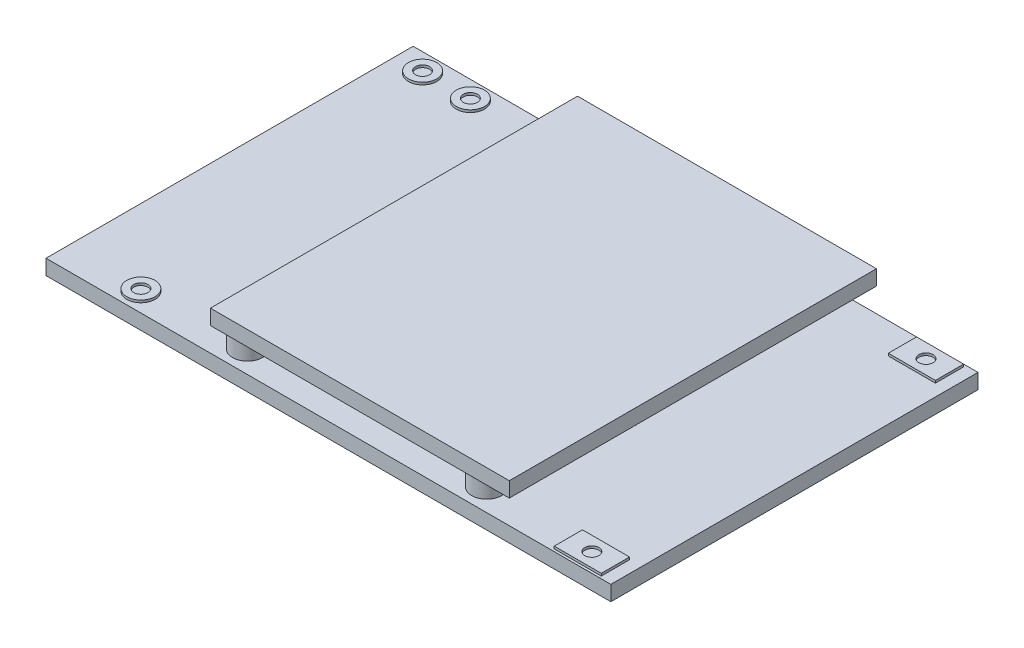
from build123d import *

# Parameters (mm, degrees)
SKETCH1_W           = 60
SKETCH1_H           = 39
BOSS_EXTRUDE1_DEPTH = 1.6002
SKETCH2_R           = 1.5875
BOSS_EXTRUDE2_DEPTH = 2.54
SKETCH3_W           = 31.75
SKETCH3_H           = 39
BOSS_EXTRUDE3_DEPTH = 1.6002
SKETCH4_R           = 1.5
SKETCH4_R_2         = 0.75
SKETCH4_W           = 5
SKETCH4_H           = 3
BOSS_EXTRUDE4_DEPTH = 0.254


with BuildPart() as part:
    # Sketch1 → Boss-Extrude1 (new body)
    with BuildSketch(Plane(origin=(0, 0, 0), x_dir=(1, 0, 0), z_dir=(0, 1, 0))):
        Rectangle(SKETCH1_W, SKETCH1_H)
    extrude(amount=BOSS_EXTRUDE1_DEPTH)

    # Sketch2 → Boss-Extrude2 (add)
    with BuildSketch(Plane(origin=(0, 1.6002, 0), x_dir=(1, 0, 0), z_dir=(0, 1, 0))):
        with Locations(Location((-10.95, -17.145, 0), (0, 0, 90))):
            Circle(SKETCH2_R)
        with Locations(Location((-10.95, 17.145, 0), (0, 0, 90))):
            Circle(SKETCH2_R)
        with Locations(Location((14.45, 17.145, 0), (0, 0, 90))):
            Circle(SKETCH2_R)
        with Locations(Location((14.45, -17.145, 0), (0, 0, 90))):
            Circle(SKETCH2_R)
    extrude(amount=BOSS_EXTRUDE2_DEPTH)

    # Sketch3 → Boss-Extrude3 (add)
    with BuildSketch(Plane(origin=(0, 4.1402, 0), x_dir=(1, 0, 0), z_dir=(0, 1, 0))):
        with Locations((3.3375, 0)):
            Rectangle(SKETCH3_W, SKETCH3_H)
    extrude(amount=BOSS_EXTRUDE3_DEPTH)

    # Sketch4 → Boss-Extrude4 (add)
    # profile 1 of 5: a face of its own
    with BuildSketch(Plane(origin=(0, 1.6002, 0), x_dir=(1, 0, 0), z_dir=(0, 1, 0))):
        with Locations(Location((-27, 17.5, 0), (0, 0, 90))):
            Circle(SKETCH4_R)
        with Locations(Location((-27, 17.5, 0), (0, 0, 90))):
            Circle(SKETCH4_R_2, mode=Mode.SUBTRACT)
    # profile 2 of 5: a face of its own
    with BuildSketch(Plane(origin=(0, 1.6002, 0), x_dir=(1, 0, 0), z_dir=(0, 1, 0))):
        with Locations(Location((-21.92, 17.5, 0), (0, 0, 90))):
            Circle(SKETCH4_R)
        with Locations(Location((-21.92, 17.5, 0), (0, 0, 90))):
            Circle(SKETCH4_R_2, mode=Mode.SUBTRACT)
    # profile 3 of 5: a face of its own
    with BuildSketch(Plane(origin=(0, 1.6002, 0), x_dir=(1, 0, 0), z_dir=(0, 1, 0))):
        with Locations(Location((-21.92, -17.5, 0), (0, 0, 90))):
            Circle(SKETCH4_R)
        with Locations(Location((-21.92, -17.5, 0), (0, 0, 90))):
            Circle(SKETCH4_R_2, mode=Mode.SUBTRACT)
    # profile 4 of 5: a face of its own
    with BuildSketch(Plane(origin=(0, 1.6002, 0), x_dir=(1, 0, 0), z_dir=(0, 1, 0))):
        with Locations((26.23, 17.746)):
            Rectangle(SKETCH4_W, SKETCH4_H)
        with Locations(Location((26.23, 17.746, 0), (0, 0, 90))):
            Circle(SKETCH4_R_2, mode=Mode.SUBTRACT)
    # profile 5 of 5: a face of its own
    with BuildSketch(Plane(origin=(0, 1.6002, 0), x_dir=(1, 0, 0), z_dir=(0, 1, 0))):
        with Locations((26.23, -17.746)):
            Rectangle(SKETCH4_W, SKETCH4_H)
        with Locations(Location((26.23, -17.746, 0), (0, 0, 90))):
            Circle(SKETCH4_R_2, mode=Mode.SUBTRACT)
    extrude(amount=BOSS_EXTRUDE4_DEPTH)


solid = part.part
